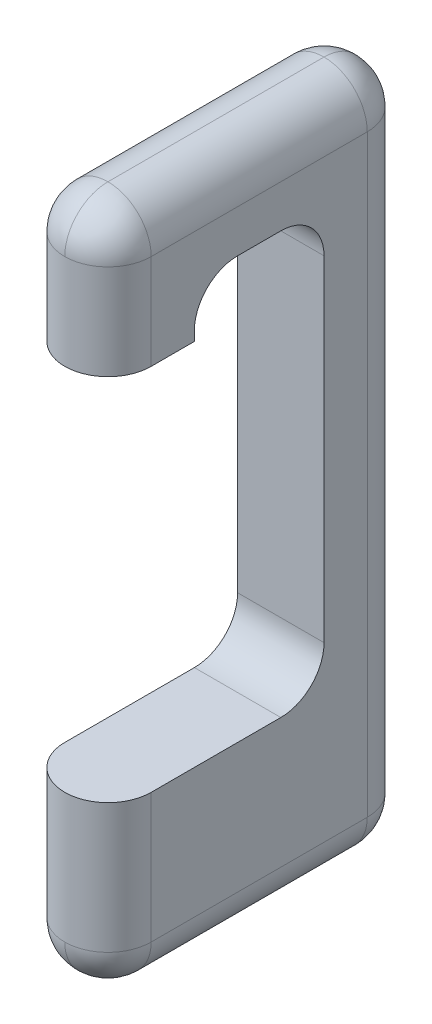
ISO-10303-21;
HEADER;
FILE_DESCRIPTION(('STEP AP214'),'2;1');
FILE_NAME('part.step','',(''),(''),'','','');
FILE_SCHEMA(('AUTOMOTIVE_DESIGN { 1 0 10303 214 1 1 1 1 }'));
ENDSEC;
DATA;
#1=APPLICATION_CONTEXT('core data for automotive mechanical design processes');
#2=APPLICATION_PROTOCOL_DEFINITION('international standard','automotive_design',2000,#1);
#3=PRODUCT_CONTEXT('',#1,'mechanical');
#4=PRODUCT('Part','Part','',(#3));
#5=PRODUCT_RELATED_PRODUCT_CATEGORY('part','',(#4));
#6=PRODUCT_DEFINITION_FORMATION('','',#4);
#7=PRODUCT_DEFINITION_CONTEXT('part definition',#1,'design');
#8=PRODUCT_DEFINITION('design','',#6,#7);
#9=PRODUCT_DEFINITION_SHAPE('','',#8);
#10=(LENGTH_UNIT() NAMED_UNIT(*) SI_UNIT(.MILLI.,.METRE.));
#11=(NAMED_UNIT(*) PLANE_ANGLE_UNIT() SI_UNIT($,.RADIAN.));
#12=(NAMED_UNIT(*) SI_UNIT($,.STERADIAN.) SOLID_ANGLE_UNIT());
#13=UNCERTAINTY_MEASURE_WITH_UNIT(LENGTH_MEASURE(1.E-05),#10,'distance_accuracy_value','');
#14=(GEOMETRIC_REPRESENTATION_CONTEXT(3) GLOBAL_UNCERTAINTY_ASSIGNED_CONTEXT((#13)) GLOBAL_UNIT_ASSIGNED_CONTEXT((#10,
#11,#12)) REPRESENTATION_CONTEXT('',''));
#15=CARTESIAN_POINT('',(0.,0.,0.));
#16=DIRECTION('',(0.,0.,1.));
#17=DIRECTION('',(1.,0.,0.));
#18=AXIS2_PLACEMENT_3D('',#15,#16,#17);
#19=CARTESIAN_POINT('',(0.79375,5.9817,11.90625));
#20=DIRECTION('',(0.,1.,0.));
#21=DIRECTION('',(0.,0.,1.));
#22=AXIS2_PLACEMENT_3D('',#19,#20,#21);
#23=PLANE('',#22);
#24=DIRECTION('',(0.,0.,-1.));
#25=VECTOR('',#24,1.);
#26=CARTESIAN_POINT('',(0.79375,5.9817,11.90625));
#27=LINE('',#26,#25);
#28=CARTESIAN_POINT('',(0.793750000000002,5.9817,12.7));
#29=VERTEX_POINT('',#28);
#30=CARTESIAN_POINT('',(0.79375,5.9817,11.90625));
#31=VERTEX_POINT('',#30);
#32=EDGE_CURVE('E275',#29,#31,#27,.T.);
#33=ORIENTED_EDGE('',*,*,#32,.F.);
#34=CARTESIAN_POINT('',(0.,5.9817,12.7));
#35=DIRECTION('',(0.,1.,0.));
#36=DIRECTION('',(0.,0.,1.));
#37=AXIS2_PLACEMENT_3D('',#34,#35,#36);
#38=CIRCLE('',#37,0.793750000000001);
#39=CARTESIAN_POINT('',(-0.79375,5.9817,12.7));
#40=VERTEX_POINT('',#39);
#41=EDGE_CURVE('E290',#40,#29,#38,.T.);
#42=ORIENTED_EDGE('',*,*,#41,.F.);
#43=DIRECTION('',(0.,0.,-1.));
#44=VECTOR('',#43,1.);
#45=CARTESIAN_POINT('',(-0.79375,5.9817,11.90625));
#46=LINE('',#45,#44);
#47=CARTESIAN_POINT('',(-0.79375,5.9817,11.90625));
#48=VERTEX_POINT('',#47);
#49=EDGE_CURVE('E288',#40,#48,#46,.T.);
#50=ORIENTED_EDGE('',*,*,#49,.T.);
#51=DIRECTION('',(-1.,0.,0.));
#52=VECTOR('',#51,1.);
#53=CARTESIAN_POINT('',(0.79375,5.9817,11.90625));
#54=LINE('',#53,#52);
#55=EDGE_CURVE('E250',#31,#48,#54,.T.);
#56=ORIENTED_EDGE('',*,*,#55,.F.);
#57=EDGE_LOOP('',(#33,#42,#50,#56));
#58=FACE_BOUND('',#57,.T.);
#59=ADVANCED_FACE('F49',(#58),#23,.F.);
#60=CARTESIAN_POINT('',(0.79375,-0.793750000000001,10.31875));
#61=DIRECTION('',(0.,-1.,0.));
#62=DIRECTION('',(0.,0.,-1.));
#63=AXIS2_PLACEMENT_3D('',#60,#61,#62);
#64=PLANE('',#63);
#65=CARTESIAN_POINT('',(0.,-0.793750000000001,12.7));
#66=DIRECTION('',(0.,-1.,0.));
#67=DIRECTION('',(0.,0.,-1.));
#68=AXIS2_PLACEMENT_3D('',#65,#66,#67);
#69=CIRCLE('',#68,0.793750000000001);
#70=CARTESIAN_POINT('',(0.793750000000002,-0.793750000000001,12.7));
#71=VERTEX_POINT('',#70);
#72=CARTESIAN_POINT('',(-0.79375,-0.793750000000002,12.7));
#73=VERTEX_POINT('',#72);
#74=EDGE_CURVE('E307',#71,#73,#69,.T.);
#75=ORIENTED_EDGE('',*,*,#74,.F.);
#76=DIRECTION('',(0.,0.,1.));
#77=VECTOR('',#76,1.);
#78=CARTESIAN_POINT('',(0.79375,-0.793750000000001,10.31875));
#79=LINE('',#78,#77);
#80=CARTESIAN_POINT('',(0.79375,-0.793750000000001,10.31875));
#81=VERTEX_POINT('',#80);
#82=EDGE_CURVE('E271',#81,#71,#79,.T.);
#83=ORIENTED_EDGE('',*,*,#82,.F.);
#84=DIRECTION('',(-1.,0.,0.));
#85=VECTOR('',#84,1.);
#86=CARTESIAN_POINT('',(0.79375,-0.793750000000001,10.31875));
#87=LINE('',#86,#85);
#88=CARTESIAN_POINT('',(-0.79375,-0.793750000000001,10.31875));
#89=VERTEX_POINT('',#88);
#90=EDGE_CURVE('E268',#81,#89,#87,.T.);
#91=ORIENTED_EDGE('',*,*,#90,.T.);
#92=DIRECTION('',(0.,0.,1.));
#93=VECTOR('',#92,1.);
#94=CARTESIAN_POINT('',(-0.79375,-0.793750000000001,10.31875));
#95=LINE('',#94,#93);
#96=EDGE_CURVE('E272',#89,#73,#95,.T.);
#97=ORIENTED_EDGE('',*,*,#96,.T.);
#98=EDGE_LOOP('',(#75,#83,#91,#97));
#99=FACE_BOUND('',#98,.T.);
#100=ADVANCED_FACE('F332',(#99),#64,.F.);
#101=CARTESIAN_POINT('',(0.79375,-3.175,12.7));
#102=DIRECTION('',(-1.,0.,0.));
#103=DIRECTION('',(0.,0.,1.));
#104=AXIS2_PLACEMENT_3D('',#101,#102,#103);
#105=PLANE('',#104);
#106=DIRECTION('',(0.,1.,0.));
#107=VECTOR('',#106,1.);
#108=CARTESIAN_POINT('',(0.793750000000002,-3.96875,12.7));
#109=LINE('',#108,#107);
#110=CARTESIAN_POINT('',(0.793750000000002,-3.175,12.7));
#111=VERTEX_POINT('',#110);
#112=EDGE_CURVE('E311',#111,#71,#109,.T.);
#113=ORIENTED_EDGE('',*,*,#112,.F.);
#114=DIRECTION('',(0.,0.,-1.));
#115=VECTOR('',#114,1.);
#116=CARTESIAN_POINT('',(0.79375,-3.175,12.7));
#117=LINE('',#116,#115);
#118=CARTESIAN_POINT('',(0.793749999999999,-3.175,8.73125));
#119=VERTEX_POINT('',#118);
#120=EDGE_CURVE('E231',#111,#119,#117,.T.);
#121=ORIENTED_EDGE('',*,*,#120,.T.);
#122=DIRECTION('',(0.,1.,0.));
#123=VECTOR('',#122,1.);
#124=CARTESIAN_POINT('',(0.793749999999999,-3.96875,8.73125));
#125=LINE('',#124,#123);
#126=CARTESIAN_POINT('',(0.793749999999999,7.72795,8.73125));
#127=VERTEX_POINT('',#126);
#128=EDGE_CURVE('E313',#119,#127,#125,.T.);
#129=ORIENTED_EDGE('',*,*,#128,.T.);
#130=DIRECTION('',(0.,0.,1.));
#131=VECTOR('',#130,1.);
#132=CARTESIAN_POINT('',(0.79375,7.72795,12.7));
#133=LINE('',#132,#131);
#134=CARTESIAN_POINT('',(0.793750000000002,7.72795,12.7));
#135=VERTEX_POINT('',#134);
#136=EDGE_CURVE('E68',#127,#135,#133,.T.);
#137=ORIENTED_EDGE('',*,*,#136,.T.);
#138=EDGE_CURVE('E214',#29,#135,#109,.T.);
#139=ORIENTED_EDGE('',*,*,#138,.F.);
#140=ORIENTED_EDGE('',*,*,#32,.T.);
#141=DIRECTION('',(0.,1.,0.));
#142=VECTOR('',#141,1.);
#143=CARTESIAN_POINT('',(0.79375,5.9817,11.90625));
#144=LINE('',#143,#142);
#145=CARTESIAN_POINT('',(0.79375,6.15315,11.90625));
#146=VERTEX_POINT('',#145);
#147=EDGE_CURVE('E303',#31,#146,#144,.T.);
#148=ORIENTED_EDGE('',*,*,#147,.T.);
#149=CARTESIAN_POINT('',(0.79375,6.15315,11.1125));
#150=DIRECTION('',(-1.,0.,0.));
#151=DIRECTION('',(0.,0.,1.));
#152=AXIS2_PLACEMENT_3D('',#149,#150,#151);
#153=CIRCLE('',#152,0.793750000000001);
#154=CARTESIAN_POINT('',(0.79375,6.9469,11.1125));
#155=VERTEX_POINT('',#154);
#156=EDGE_CURVE('E301',#146,#155,#153,.T.);
#157=ORIENTED_EDGE('',*,*,#156,.T.);
#158=DIRECTION('',(0.,0.,-1.));
#159=VECTOR('',#158,1.);
#160=CARTESIAN_POINT('',(0.79375,6.9469,11.1125));
#161=LINE('',#160,#159);
#162=CARTESIAN_POINT('',(0.79375,6.9469,10.31875));
#163=VERTEX_POINT('',#162);
#164=EDGE_CURVE('E299',#155,#163,#161,.T.);
#165=ORIENTED_EDGE('',*,*,#164,.T.);
#166=CARTESIAN_POINT('',(0.79375,6.15315,10.31875));
#167=DIRECTION('',(-1.,0.,0.));
#168=DIRECTION('',(0.,0.,-1.));
#169=AXIS2_PLACEMENT_3D('',#166,#167,#168);
#170=CIRCLE('',#169,0.793749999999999);
#171=CARTESIAN_POINT('',(0.79375,6.15315,9.525));
#172=VERTEX_POINT('',#171);
#173=EDGE_CURVE('E297',#163,#172,#170,.T.);
#174=ORIENTED_EDGE('',*,*,#173,.T.);
#175=DIRECTION('',(0.,-1.,0.));
#176=VECTOR('',#175,1.);
#177=CARTESIAN_POINT('',(0.79375,0.,9.525));
#178=LINE('',#177,#176);
#179=CARTESIAN_POINT('',(0.79375,0.,9.525));
#180=VERTEX_POINT('',#179);
#181=EDGE_CURVE('E295',#172,#180,#178,.T.);
#182=ORIENTED_EDGE('',*,*,#181,.T.);
#183=CARTESIAN_POINT('',(0.79375,0.,10.31875));
#184=DIRECTION('',(-1.,0.,0.));
#185=DIRECTION('',(0.,0.,1.));
#186=AXIS2_PLACEMENT_3D('',#183,#184,#185);
#187=CIRCLE('',#186,0.79375);
#188=EDGE_CURVE('E293',#180,#81,#187,.T.);
#189=ORIENTED_EDGE('',*,*,#188,.T.);
#190=ORIENTED_EDGE('',*,*,#82,.T.);
#191=EDGE_LOOP('',(#113,#121,#129,#137,#139,#140,#148,#157,#165,#174,#182,#189,#190));
#192=FACE_BOUND('',#191,.T.);
#193=ADVANCED_FACE('F369',(#192),#105,.F.);
#194=CARTESIAN_POINT('',(-0.79375,-3.175,12.7));
#195=DIRECTION('',(-1.,0.,0.));
#196=DIRECTION('',(0.,0.,1.));
#197=AXIS2_PLACEMENT_3D('',#194,#195,#196);
#198=PLANE('',#197);
#199=DIRECTION('',(0.,1.,0.));
#200=VECTOR('',#199,1.);
#201=CARTESIAN_POINT('',(-0.79375,-3.96875,8.73125));
#202=LINE('',#201,#200);
#203=CARTESIAN_POINT('',(-0.79375,-3.175,8.73125));
#204=VERTEX_POINT('',#203);
#205=CARTESIAN_POINT('',(-0.79375,7.72795,8.73125));
#206=VERTEX_POINT('',#205);
#207=EDGE_CURVE('E315',#204,#206,#202,.T.);
#208=ORIENTED_EDGE('',*,*,#207,.F.);
#209=DIRECTION('',(0.,0.,-1.));
#210=VECTOR('',#209,1.);
#211=CARTESIAN_POINT('',(-0.79375,-3.175,12.7));
#212=LINE('',#211,#210);
#213=CARTESIAN_POINT('',(-0.79375,-3.175,12.7));
#214=VERTEX_POINT('',#213);
#215=EDGE_CURVE('E14',#204,#214,#212,.F.);
#216=ORIENTED_EDGE('',*,*,#215,.T.);
#217=DIRECTION('',(0.,1.,0.));
#218=VECTOR('',#217,1.);
#219=CARTESIAN_POINT('',(-0.79375,-3.96875,12.7));
#220=LINE('',#219,#218);
#221=EDGE_CURVE('E310',#214,#73,#220,.T.);
#222=ORIENTED_EDGE('',*,*,#221,.T.);
#223=ORIENTED_EDGE('',*,*,#96,.F.);
#224=CARTESIAN_POINT('',(-0.79375,0.,10.31875));
#225=DIRECTION('',(-1.,0.,0.));
#226=DIRECTION('',(0.,0.,1.));
#227=AXIS2_PLACEMENT_3D('',#224,#225,#226);
#228=CIRCLE('',#227,0.79375);
#229=CARTESIAN_POINT('',(-0.79375,0.,9.525));
#230=VERTEX_POINT('',#229);
#231=EDGE_CURVE('E276',#230,#89,#228,.T.);
#232=ORIENTED_EDGE('',*,*,#231,.F.);
#233=DIRECTION('',(0.,-1.,0.));
#234=VECTOR('',#233,1.);
#235=CARTESIAN_POINT('',(-0.79375,0.,9.525));
#236=LINE('',#235,#234);
#237=CARTESIAN_POINT('',(-0.79375,6.15315,9.525));
#238=VERTEX_POINT('',#237);
#239=EDGE_CURVE('E278',#238,#230,#236,.T.);
#240=ORIENTED_EDGE('',*,*,#239,.F.);
#241=CARTESIAN_POINT('',(-0.79375,6.15315,10.31875));
#242=DIRECTION('',(-1.,0.,0.));
#243=DIRECTION('',(0.,0.,-1.));
#244=AXIS2_PLACEMENT_3D('',#241,#242,#243);
#245=CIRCLE('',#244,0.793749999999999);
#246=CARTESIAN_POINT('',(-0.79375,6.9469,10.31875));
#247=VERTEX_POINT('',#246);
#248=EDGE_CURVE('E280',#247,#238,#245,.T.);
#249=ORIENTED_EDGE('',*,*,#248,.F.);
#250=DIRECTION('',(0.,0.,-1.));
#251=VECTOR('',#250,1.);
#252=CARTESIAN_POINT('',(-0.79375,6.9469,11.1125));
#253=LINE('',#252,#251);
#254=CARTESIAN_POINT('',(-0.79375,6.9469,11.1125));
#255=VERTEX_POINT('',#254);
#256=EDGE_CURVE('E282',#255,#247,#253,.T.);
#257=ORIENTED_EDGE('',*,*,#256,.F.);
#258=CARTESIAN_POINT('',(-0.79375,6.15315,11.1125));
#259=DIRECTION('',(-1.,0.,0.));
#260=DIRECTION('',(0.,0.,1.));
#261=AXIS2_PLACEMENT_3D('',#258,#259,#260);
#262=CIRCLE('',#261,0.793750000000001);
#263=CARTESIAN_POINT('',(-0.79375,6.15315,11.90625));
#264=VERTEX_POINT('',#263);
#265=EDGE_CURVE('E284',#264,#255,#262,.T.);
#266=ORIENTED_EDGE('',*,*,#265,.F.);
#267=DIRECTION('',(0.,1.,0.));
#268=VECTOR('',#267,1.);
#269=CARTESIAN_POINT('',(-0.79375,5.9817,11.90625));
#270=LINE('',#269,#268);
#271=EDGE_CURVE('E286',#48,#264,#270,.T.);
#272=ORIENTED_EDGE('',*,*,#271,.F.);
#273=ORIENTED_EDGE('',*,*,#49,.F.);
#274=DIRECTION('',(0.,1.,0.));
#275=VECTOR('',#274,1.);
#276=CARTESIAN_POINT('',(-0.79375,-3.96875,12.7));
#277=LINE('',#276,#275);
#278=CARTESIAN_POINT('',(-0.79375,7.72795,12.7));
#279=VERTEX_POINT('',#278);
#280=EDGE_CURVE('E247',#40,#279,#277,.T.);
#281=ORIENTED_EDGE('',*,*,#280,.T.);
#282=DIRECTION('',(0.,0.,1.));
#283=VECTOR('',#282,1.);
#284=CARTESIAN_POINT('',(-0.79375,7.72795,8.73125));
#285=LINE('',#284,#283);
#286=EDGE_CURVE('E59',#279,#206,#285,.F.);
#287=ORIENTED_EDGE('',*,*,#286,.T.);
#288=EDGE_LOOP('',(#208,#216,#222,#223,#232,#240,#249,#257,#266,#272,#273,#281,#287));
#289=FACE_BOUND('',#288,.T.);
#290=ADVANCED_FACE('F322',(#289),#198,.T.);
#291=CARTESIAN_POINT('',(0.79375,5.9817,11.90625));
#292=DIRECTION('',(0.,0.,1.));
#293=DIRECTION('',(0.,-1.,0.));
#294=AXIS2_PLACEMENT_3D('',#291,#292,#293);
#295=PLANE('',#294);
#296=ORIENTED_EDGE('',*,*,#271,.T.);
#297=DIRECTION('',(-1.,0.,0.));
#298=VECTOR('',#297,1.);
#299=CARTESIAN_POINT('',(0.79375,6.15315,11.90625));
#300=LINE('',#299,#298);
#301=EDGE_CURVE('E253',#146,#264,#300,.T.);
#302=ORIENTED_EDGE('',*,*,#301,.F.);
#303=ORIENTED_EDGE('',*,*,#147,.F.);
#304=ORIENTED_EDGE('',*,*,#55,.T.);
#305=EDGE_LOOP('',(#296,#302,#303,#304));
#306=FACE_BOUND('',#305,.T.);
#307=ADVANCED_FACE('F362',(#306),#295,.F.);
#308=CARTESIAN_POINT('',(0.79375,6.15315,11.1125));
#309=DIRECTION('',(-1.,0.,0.));
#310=DIRECTION('',(0.,0.,1.));
#311=AXIS2_PLACEMENT_3D('',#308,#309,#310);
#312=CYLINDRICAL_SURFACE('',#311,0.793750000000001);
#313=ORIENTED_EDGE('',*,*,#265,.T.);
#314=DIRECTION('',(-1.,0.,0.));
#315=VECTOR('',#314,1.);
#316=CARTESIAN_POINT('',(0.79375,6.9469,11.1125));
#317=LINE('',#316,#315);
#318=EDGE_CURVE('E256',#155,#255,#317,.T.);
#319=ORIENTED_EDGE('',*,*,#318,.F.);
#320=ORIENTED_EDGE('',*,*,#156,.F.);
#321=ORIENTED_EDGE('',*,*,#301,.T.);
#322=EDGE_LOOP('',(#313,#319,#320,#321));
#323=FACE_BOUND('',#322,.T.);
#324=ADVANCED_FACE('F357',(#323),#312,.F.);
#325=CARTESIAN_POINT('',(0.79375,6.9469,11.1125));
#326=DIRECTION('',(0.,1.,0.));
#327=DIRECTION('',(0.,0.,1.));
#328=AXIS2_PLACEMENT_3D('',#325,#326,#327);
#329=PLANE('',#328);
#330=ORIENTED_EDGE('',*,*,#256,.T.);
#331=DIRECTION('',(-1.,0.,0.));
#332=VECTOR('',#331,1.);
#333=CARTESIAN_POINT('',(0.79375,6.9469,10.31875));
#334=LINE('',#333,#332);
#335=EDGE_CURVE('E259',#163,#247,#334,.T.);
#336=ORIENTED_EDGE('',*,*,#335,.F.);
#337=ORIENTED_EDGE('',*,*,#164,.F.);
#338=ORIENTED_EDGE('',*,*,#318,.T.);
#339=EDGE_LOOP('',(#330,#336,#337,#338));
#340=FACE_BOUND('',#339,.T.);
#341=ADVANCED_FACE('F351',(#340),#329,.F.);
#342=CARTESIAN_POINT('',(0.79375,6.15315,10.31875));
#343=DIRECTION('',(-1.,0.,0.));
#344=DIRECTION('',(0.,0.,1.));
#345=AXIS2_PLACEMENT_3D('',#342,#343,#344);
#346=CYLINDRICAL_SURFACE('',#345,0.793749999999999);
#347=ORIENTED_EDGE('',*,*,#248,.T.);
#348=DIRECTION('',(-1.,0.,0.));
#349=VECTOR('',#348,1.);
#350=CARTESIAN_POINT('',(0.79375,6.15315,9.525));
#351=LINE('',#350,#349);
#352=EDGE_CURVE('E262',#172,#238,#351,.T.);
#353=ORIENTED_EDGE('',*,*,#352,.F.);
#354=ORIENTED_EDGE('',*,*,#173,.F.);
#355=ORIENTED_EDGE('',*,*,#335,.T.);
#356=EDGE_LOOP('',(#347,#353,#354,#355));
#357=FACE_BOUND('',#356,.T.);
#358=ADVANCED_FACE('F347',(#357),#346,.F.);
#359=CARTESIAN_POINT('',(0.79375,0.,9.525));
#360=DIRECTION('',(0.,0.,-1.));
#361=DIRECTION('',(-1.,0.,0.));
#362=AXIS2_PLACEMENT_3D('',#359,#360,#361);
#363=PLANE('',#362);
#364=ORIENTED_EDGE('',*,*,#239,.T.);
#365=DIRECTION('',(-1.,0.,0.));
#366=VECTOR('',#365,1.);
#367=CARTESIAN_POINT('',(0.79375,0.,9.525));
#368=LINE('',#367,#366);
#369=EDGE_CURVE('E265',#180,#230,#368,.T.);
#370=ORIENTED_EDGE('',*,*,#369,.F.);
#371=ORIENTED_EDGE('',*,*,#181,.F.);
#372=ORIENTED_EDGE('',*,*,#352,.T.);
#373=EDGE_LOOP('',(#364,#370,#371,#372));
#374=FACE_BOUND('',#373,.T.);
#375=ADVANCED_FACE('F342',(#374),#363,.F.);
#376=CARTESIAN_POINT('',(0.79375,0.,10.31875));
#377=DIRECTION('',(-1.,0.,0.));
#378=DIRECTION('',(0.,0.,1.));
#379=AXIS2_PLACEMENT_3D('',#376,#377,#378);
#380=CYLINDRICAL_SURFACE('',#379,0.79375);
#381=ORIENTED_EDGE('',*,*,#231,.T.);
#382=ORIENTED_EDGE('',*,*,#90,.F.);
#383=ORIENTED_EDGE('',*,*,#188,.F.);
#384=ORIENTED_EDGE('',*,*,#369,.T.);
#385=EDGE_LOOP('',(#381,#382,#383,#384));
#386=FACE_BOUND('',#385,.T.);
#387=ADVANCED_FACE('F336',(#386),#380,.F.);
#388=CARTESIAN_POINT('',(0.,-3.96875,8.73125));
#389=DIRECTION('',(0.,1.,0.));
#390=DIRECTION('',(0.,0.,1.));
#391=AXIS2_PLACEMENT_3D('',#388,#389,#390);
#392=CYLINDRICAL_SURFACE('',#391,0.79375);
#393=ORIENTED_EDGE('',*,*,#128,.F.);
#394=CARTESIAN_POINT('',(0.,-3.175,8.73125));
#395=DIRECTION('',(0.,1.,0.));
#396=DIRECTION('',(0.,0.,1.));
#397=AXIS2_PLACEMENT_3D('',#394,#395,#396);
#398=CIRCLE('',#397,0.79375);
#399=CARTESIAN_POINT('',(0.,-3.175,7.9375));
#400=VERTEX_POINT('',#399);
#401=EDGE_CURVE('E236',#119,#400,#398,.T.);
#402=ORIENTED_EDGE('',*,*,#401,.T.);
#403=CARTESIAN_POINT('',(0.,-3.175,8.73125));
#404=DIRECTION('',(0.,1.,0.));
#405=DIRECTION('',(0.,0.,1.));
#406=AXIS2_PLACEMENT_3D('',#403,#404,#405);
#407=CIRCLE('',#406,0.79375);
#408=EDGE_CURVE('E238',#400,#204,#407,.T.);
#409=ORIENTED_EDGE('',*,*,#408,.T.);
#410=ORIENTED_EDGE('',*,*,#207,.T.);
#411=CARTESIAN_POINT('',(0.,7.72795,8.73125));
#412=DIRECTION('',(0.,1.,0.));
#413=DIRECTION('',(0.,0.,1.));
#414=AXIS2_PLACEMENT_3D('',#411,#412,#413);
#415=CIRCLE('',#414,0.79375);
#416=CARTESIAN_POINT('',(0.,7.72795,7.9375));
#417=VERTEX_POINT('',#416);
#418=EDGE_CURVE('E209',#206,#417,#415,.F.);
#419=ORIENTED_EDGE('',*,*,#418,.T.);
#420=CARTESIAN_POINT('',(0.,7.72795,8.73125));
#421=DIRECTION('',(0.,1.,0.));
#422=DIRECTION('',(0.,0.,1.));
#423=AXIS2_PLACEMENT_3D('',#420,#421,#422);
#424=CIRCLE('',#423,0.79375);
#425=EDGE_CURVE('E126',#417,#127,#424,.F.);
#426=ORIENTED_EDGE('',*,*,#425,.T.);
#427=EDGE_LOOP('',(#393,#402,#409,#410,#419,#426));
#428=FACE_BOUND('',#427,.T.);
#429=ADVANCED_FACE('F374',(#428),#392,.T.);
#430=CARTESIAN_POINT('',(0.,-3.96875,12.7));
#431=DIRECTION('',(0.,1.,0.));
#432=DIRECTION('',(0.,0.,1.));
#433=AXIS2_PLACEMENT_3D('',#430,#431,#432);
#434=CYLINDRICAL_SURFACE('',#433,0.793750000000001);
#435=CARTESIAN_POINT('',(0.,7.72795,12.7));
#436=DIRECTION('',(0.,1.,0.));
#437=DIRECTION('',(0.,0.,1.));
#438=AXIS2_PLACEMENT_3D('',#435,#436,#437);
#439=CIRCLE('',#438,0.793750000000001);
#440=CARTESIAN_POINT('',(0.,7.72795,13.49375));
#441=VERTEX_POINT('',#440);
#442=EDGE_CURVE('E98',#135,#441,#439,.F.);
#443=ORIENTED_EDGE('',*,*,#442,.T.);
#444=CARTESIAN_POINT('',(0.,7.72795,12.7));
#445=DIRECTION('',(0.,1.,0.));
#446=DIRECTION('',(0.,0.,1.));
#447=AXIS2_PLACEMENT_3D('',#444,#445,#446);
#448=CIRCLE('',#447,0.793750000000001);
#449=EDGE_CURVE('E106',#441,#279,#448,.F.);
#450=ORIENTED_EDGE('',*,*,#449,.T.);
#451=ORIENTED_EDGE('',*,*,#280,.F.);
#452=ORIENTED_EDGE('',*,*,#41,.T.);
#453=ORIENTED_EDGE('',*,*,#138,.T.);
#454=EDGE_LOOP('',(#443,#450,#451,#452,#453));
#455=FACE_BOUND('',#454,.T.);
#456=ADVANCED_FACE('F368',(#455),#434,.T.);
#457=CARTESIAN_POINT('',(0.,-3.175,12.7));
#458=DIRECTION('',(0.,1.,0.));
#459=DIRECTION('',(0.,0.,1.));
#460=AXIS2_PLACEMENT_3D('',#457,#458,#459);
#461=CIRCLE('',#460,0.793750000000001);
#462=CARTESIAN_POINT('',(0.,-3.175,13.49375));
#463=VERTEX_POINT('',#462);
#464=EDGE_CURVE('E245',#214,#463,#461,.T.);
#465=ORIENTED_EDGE('',*,*,#464,.T.);
#466=CARTESIAN_POINT('',(0.,-3.175,12.7));
#467=DIRECTION('',(0.,1.,0.));
#468=DIRECTION('',(0.,0.,1.));
#469=AXIS2_PLACEMENT_3D('',#466,#467,#468);
#470=CIRCLE('',#469,0.793750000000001);
#471=EDGE_CURVE('E242',#463,#111,#470,.T.);
#472=ORIENTED_EDGE('',*,*,#471,.T.);
#473=ORIENTED_EDGE('',*,*,#112,.T.);
#474=ORIENTED_EDGE('',*,*,#74,.T.);
#475=ORIENTED_EDGE('',*,*,#221,.F.);
#476=EDGE_LOOP('',(#465,#472,#473,#474,#475));
#477=FACE_BOUND('',#476,.T.);
#478=ADVANCED_FACE('F328',(#477),#434,.T.);
#479=CARTESIAN_POINT('',(0.,-3.175,8.73125));
#480=DIRECTION('',(0.,0.,1.));
#481=DIRECTION('',(1.,0.,0.));
#482=AXIS2_PLACEMENT_3D('',#479,#480,#481);
#483=SPHERICAL_SURFACE('',#482,0.79375);
#484=CARTESIAN_POINT('',(0.,-3.175,8.73125));
#485=DIRECTION('',(0.,0.,1.));
#486=DIRECTION('',(0.,-1.,0.));
#487=AXIS2_PLACEMENT_3D('',#484,#485,#486);
#488=CIRCLE('',#487,0.79375);
#489=CARTESIAN_POINT('',(0.,-3.96875,8.73125));
#490=VERTEX_POINT('',#489);
#491=EDGE_CURVE('E215',#204,#490,#488,.T.);
#492=ORIENTED_EDGE('',*,*,#491,.F.);
#493=ORIENTED_EDGE('',*,*,#408,.F.);
#494=CARTESIAN_POINT('',(0.,-3.175,8.73125));
#495=DIRECTION('',(-1.,0.,0.));
#496=DIRECTION('',(0.,0.,1.));
#497=AXIS2_PLACEMENT_3D('',#494,#495,#496);
#498=CIRCLE('',#497,0.793750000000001);
#499=EDGE_CURVE('E211',#490,#400,#498,.F.);
#500=ORIENTED_EDGE('',*,*,#499,.F.);
#501=EDGE_LOOP('',(#492,#493,#500));
#502=FACE_BOUND('',#501,.T.);
#503=ADVANCED_FACE('F426',(#502),#483,.T.);
#504=CARTESIAN_POINT('',(0.,-3.175,8.73125));
#505=DIRECTION('',(0.,0.,1.));
#506=DIRECTION('',(1.,0.,0.));
#507=AXIS2_PLACEMENT_3D('',#504,#505,#506);
#508=SPHERICAL_SURFACE('',#507,0.79375);
#509=ORIENTED_EDGE('',*,*,#499,.T.);
#510=ORIENTED_EDGE('',*,*,#401,.F.);
#511=CARTESIAN_POINT('',(0.,-3.175,8.73125));
#512=DIRECTION('',(0.,0.,1.));
#513=DIRECTION('',(1.,0.,0.));
#514=AXIS2_PLACEMENT_3D('',#511,#512,#513);
#515=CIRCLE('',#514,0.79375);
#516=EDGE_CURVE('E220',#490,#119,#515,.T.);
#517=ORIENTED_EDGE('',*,*,#516,.F.);
#518=EDGE_LOOP('',(#509,#510,#517));
#519=FACE_BOUND('',#518,.T.);
#520=ADVANCED_FACE('F378',(#519),#508,.T.);
#521=CARTESIAN_POINT('',(0.,-3.175,8.73125));
#522=DIRECTION('',(0.,0.,1.));
#523=DIRECTION('',(0.,-1.,0.));
#524=AXIS2_PLACEMENT_3D('',#521,#522,#523);
#525=CYLINDRICAL_SURFACE('',#524,0.79375);
#526=CARTESIAN_POINT('',(0.,-3.175,12.7));
#527=DIRECTION('',(0.,0.,1.));
#528=DIRECTION('',(1.,0.,0.));
#529=AXIS2_PLACEMENT_3D('',#526,#527,#528);
#530=CIRCLE('',#529,0.79375);
#531=CARTESIAN_POINT('',(0.,-3.96875,12.7));
#532=VERTEX_POINT('',#531);
#533=EDGE_CURVE('E218',#214,#532,#530,.T.);
#534=ORIENTED_EDGE('',*,*,#533,.F.);
#535=ORIENTED_EDGE('',*,*,#215,.F.);
#536=ORIENTED_EDGE('',*,*,#491,.T.);
#537=DIRECTION('',(0.,0.,-1.));
#538=VECTOR('',#537,1.);
#539=CARTESIAN_POINT('',(0.,-3.96875,8.73125));
#540=LINE('',#539,#538);
#541=EDGE_CURVE('E223',#532,#490,#540,.T.);
#542=ORIENTED_EDGE('',*,*,#541,.F.);
#543=EDGE_LOOP('',(#534,#535,#536,#542));
#544=FACE_BOUND('',#543,.T.);
#545=ADVANCED_FACE('F382',(#544),#525,.T.);
#546=CARTESIAN_POINT('',(0.,-3.175,12.7));
#547=DIRECTION('',(0.,0.,1.));
#548=DIRECTION('',(1.,0.,0.));
#549=AXIS2_PLACEMENT_3D('',#546,#547,#548);
#550=SPHERICAL_SURFACE('',#549,0.79375);
#551=ORIENTED_EDGE('',*,*,#464,.F.);
#552=ORIENTED_EDGE('',*,*,#533,.T.);
#553=CARTESIAN_POINT('',(0.,-3.175,12.7));
#554=DIRECTION('',(-1.,0.,0.));
#555=DIRECTION('',(0.,0.,1.));
#556=AXIS2_PLACEMENT_3D('',#553,#554,#555);
#557=CIRCLE('',#556,0.79375);
#558=EDGE_CURVE('E226',#463,#532,#557,.F.);
#559=ORIENTED_EDGE('',*,*,#558,.F.);
#560=EDGE_LOOP('',(#551,#552,#559));
#561=FACE_BOUND('',#560,.T.);
#562=ADVANCED_FACE('F390',(#561),#550,.T.);
#563=CARTESIAN_POINT('',(0.,-3.175,12.7));
#564=DIRECTION('',(0.,0.,-1.));
#565=DIRECTION('',(0.,1.,0.));
#566=AXIS2_PLACEMENT_3D('',#563,#564,#565);
#567=CYLINDRICAL_SURFACE('',#566,0.79375);
#568=ORIENTED_EDGE('',*,*,#516,.T.);
#569=ORIENTED_EDGE('',*,*,#120,.F.);
#570=CARTESIAN_POINT('',(0.,-3.175,12.7));
#571=DIRECTION('',(0.,0.,1.));
#572=DIRECTION('',(1.,0.,0.));
#573=AXIS2_PLACEMENT_3D('',#570,#571,#572);
#574=CIRCLE('',#573,0.79375);
#575=EDGE_CURVE('E99',#532,#111,#574,.T.);
#576=ORIENTED_EDGE('',*,*,#575,.F.);
#577=ORIENTED_EDGE('',*,*,#541,.T.);
#578=EDGE_LOOP('',(#568,#569,#576,#577));
#579=FACE_BOUND('',#578,.T.);
#580=ADVANCED_FACE('F379',(#579),#567,.T.);
#581=CARTESIAN_POINT('',(0.,-3.175,12.7));
#582=DIRECTION('',(0.,0.,1.));
#583=DIRECTION('',(1.,0.,0.));
#584=AXIS2_PLACEMENT_3D('',#581,#582,#583);
#585=SPHERICAL_SURFACE('',#584,0.79375);
#586=ORIENTED_EDGE('',*,*,#471,.F.);
#587=ORIENTED_EDGE('',*,*,#558,.T.);
#588=ORIENTED_EDGE('',*,*,#575,.T.);
#589=EDGE_LOOP('',(#586,#587,#588));
#590=FACE_BOUND('',#589,.T.);
#591=ADVANCED_FACE('F388',(#590),#585,.T.);
#592=CARTESIAN_POINT('',(0.,7.72795,12.7));
#593=DIRECTION('',(0.,0.,1.));
#594=DIRECTION('',(1.,0.,0.));
#595=AXIS2_PLACEMENT_3D('',#592,#593,#594);
#596=SPHERICAL_SURFACE('',#595,0.79375);
#597=CARTESIAN_POINT('',(0.,7.72795,12.7));
#598=DIRECTION('',(-1.,0.,0.));
#599=DIRECTION('',(0.,0.,1.));
#600=AXIS2_PLACEMENT_3D('',#597,#598,#599);
#601=CIRCLE('',#600,0.79375);
#602=CARTESIAN_POINT('',(0.,8.5217,12.7));
#603=VERTEX_POINT('',#602);
#604=EDGE_CURVE('E95',#441,#603,#601,.T.);
#605=ORIENTED_EDGE('',*,*,#604,.F.);
#606=ORIENTED_EDGE('',*,*,#442,.F.);
#607=CARTESIAN_POINT('',(0.,7.72795,12.7));
#608=DIRECTION('',(0.,0.,-1.));
#609=DIRECTION('',(-1.,0.,0.));
#610=AXIS2_PLACEMENT_3D('',#607,#608,#609);
#611=CIRCLE('',#610,0.79375);
#612=EDGE_CURVE('E53',#603,#135,#611,.T.);
#613=ORIENTED_EDGE('',*,*,#612,.F.);
#614=EDGE_LOOP('',(#605,#606,#613));
#615=FACE_BOUND('',#614,.T.);
#616=ADVANCED_FACE('F51',(#615),#596,.T.);
#617=CARTESIAN_POINT('',(0.,7.72795,12.7));
#618=DIRECTION('',(0.,0.,1.));
#619=DIRECTION('',(1.,0.,0.));
#620=AXIS2_PLACEMENT_3D('',#617,#618,#619);
#621=CYLINDRICAL_SURFACE('',#620,0.79375);
#622=ORIENTED_EDGE('',*,*,#612,.T.);
#623=ORIENTED_EDGE('',*,*,#136,.F.);
#624=CARTESIAN_POINT('',(0.,7.72795,8.73125));
#625=DIRECTION('',(0.,0.,-1.));
#626=DIRECTION('',(-1.,0.,0.));
#627=AXIS2_PLACEMENT_3D('',#624,#625,#626);
#628=CIRCLE('',#627,0.79375);
#629=CARTESIAN_POINT('',(0.,8.5217,8.73125));
#630=VERTEX_POINT('',#629);
#631=EDGE_CURVE('E86',#630,#127,#628,.T.);
#632=ORIENTED_EDGE('',*,*,#631,.F.);
#633=DIRECTION('',(0.,0.,1.));
#634=VECTOR('',#633,1.);
#635=CARTESIAN_POINT('',(0.,8.5217,12.7));
#636=LINE('',#635,#634);
#637=EDGE_CURVE('E107',#603,#630,#636,.F.);
#638=ORIENTED_EDGE('',*,*,#637,.F.);
#639=EDGE_LOOP('',(#622,#623,#632,#638));
#640=FACE_BOUND('',#639,.T.);
#641=ADVANCED_FACE('F108',(#640),#621,.T.);
#642=CARTESIAN_POINT('',(0.,7.72795,12.7));
#643=DIRECTION('',(0.,0.,1.));
#644=DIRECTION('',(1.,0.,0.));
#645=AXIS2_PLACEMENT_3D('',#642,#643,#644);
#646=SPHERICAL_SURFACE('',#645,0.79375);
#647=ORIENTED_EDGE('',*,*,#449,.F.);
#648=ORIENTED_EDGE('',*,*,#604,.T.);
#649=CARTESIAN_POINT('',(0.,7.72795,12.7));
#650=DIRECTION('',(0.,0.,-1.));
#651=DIRECTION('',(-1.,0.,0.));
#652=AXIS2_PLACEMENT_3D('',#649,#650,#651);
#653=CIRCLE('',#652,0.79375);
#654=EDGE_CURVE('E104',#279,#603,#653,.T.);
#655=ORIENTED_EDGE('',*,*,#654,.F.);
#656=EDGE_LOOP('',(#647,#648,#655));
#657=FACE_BOUND('',#656,.T.);
#658=ADVANCED_FACE('F102',(#657),#646,.T.);
#659=CARTESIAN_POINT('',(0.,7.72795,8.73125));
#660=DIRECTION('',(0.,0.,1.));
#661=DIRECTION('',(1.,0.,0.));
#662=AXIS2_PLACEMENT_3D('',#659,#660,#661);
#663=SPHERICAL_SURFACE('',#662,0.79375);
#664=ORIENTED_EDGE('',*,*,#631,.T.);
#665=ORIENTED_EDGE('',*,*,#425,.F.);
#666=CARTESIAN_POINT('',(0.,7.72795,8.73125));
#667=DIRECTION('',(-1.,0.,0.));
#668=DIRECTION('',(0.,0.,1.));
#669=AXIS2_PLACEMENT_3D('',#666,#667,#668);
#670=CIRCLE('',#669,0.793750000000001);
#671=EDGE_CURVE('E115',#630,#417,#670,.T.);
#672=ORIENTED_EDGE('',*,*,#671,.F.);
#673=EDGE_LOOP('',(#664,#665,#672));
#674=FACE_BOUND('',#673,.T.);
#675=ADVANCED_FACE('F124',(#674),#663,.T.);
#676=CARTESIAN_POINT('',(0.,7.72795,12.7));
#677=DIRECTION('',(0.,0.,-1.));
#678=DIRECTION('',(-1.,0.,0.));
#679=AXIS2_PLACEMENT_3D('',#676,#677,#678);
#680=CYLINDRICAL_SURFACE('',#679,0.79375);
#681=ORIENTED_EDGE('',*,*,#654,.T.);
#682=ORIENTED_EDGE('',*,*,#637,.T.);
#683=CARTESIAN_POINT('',(0.,7.72795,8.73125));
#684=DIRECTION('',(0.,0.,-1.));
#685=DIRECTION('',(-1.,0.,0.));
#686=AXIS2_PLACEMENT_3D('',#683,#684,#685);
#687=CIRCLE('',#686,0.79375);
#688=EDGE_CURVE('E118',#206,#630,#687,.T.);
#689=ORIENTED_EDGE('',*,*,#688,.F.);
#690=ORIENTED_EDGE('',*,*,#286,.F.);
#691=EDGE_LOOP('',(#681,#682,#689,#690));
#692=FACE_BOUND('',#691,.T.);
#693=ADVANCED_FACE('F113',(#692),#680,.T.);
#694=CARTESIAN_POINT('',(0.,7.72795,8.73125));
#695=DIRECTION('',(0.,0.,1.));
#696=DIRECTION('',(1.,0.,0.));
#697=AXIS2_PLACEMENT_3D('',#694,#695,#696);
#698=SPHERICAL_SURFACE('',#697,0.79375);
#699=ORIENTED_EDGE('',*,*,#688,.T.);
#700=ORIENTED_EDGE('',*,*,#671,.T.);
#701=ORIENTED_EDGE('',*,*,#418,.F.);
#702=EDGE_LOOP('',(#699,#700,#701));
#703=FACE_BOUND('',#702,.T.);
#704=ADVANCED_FACE('F208',(#703),#698,.T.);
#705=CLOSED_SHELL('',(#59,#100,#193,#290,#307,#324,#341,#358,#375,#387,#429,#456,#478,#503,#520,
#545,#562,#580,#591,#616,#641,#658,#675,#693,#704));
#706=MANIFOLD_SOLID_BREP('B2',#705);
#707=ADVANCED_BREP_SHAPE_REPRESENTATION('',(#18,#706),#14);
#708=SHAPE_DEFINITION_REPRESENTATION(#9,#707);
ENDSEC;
END-ISO-10303-21;
